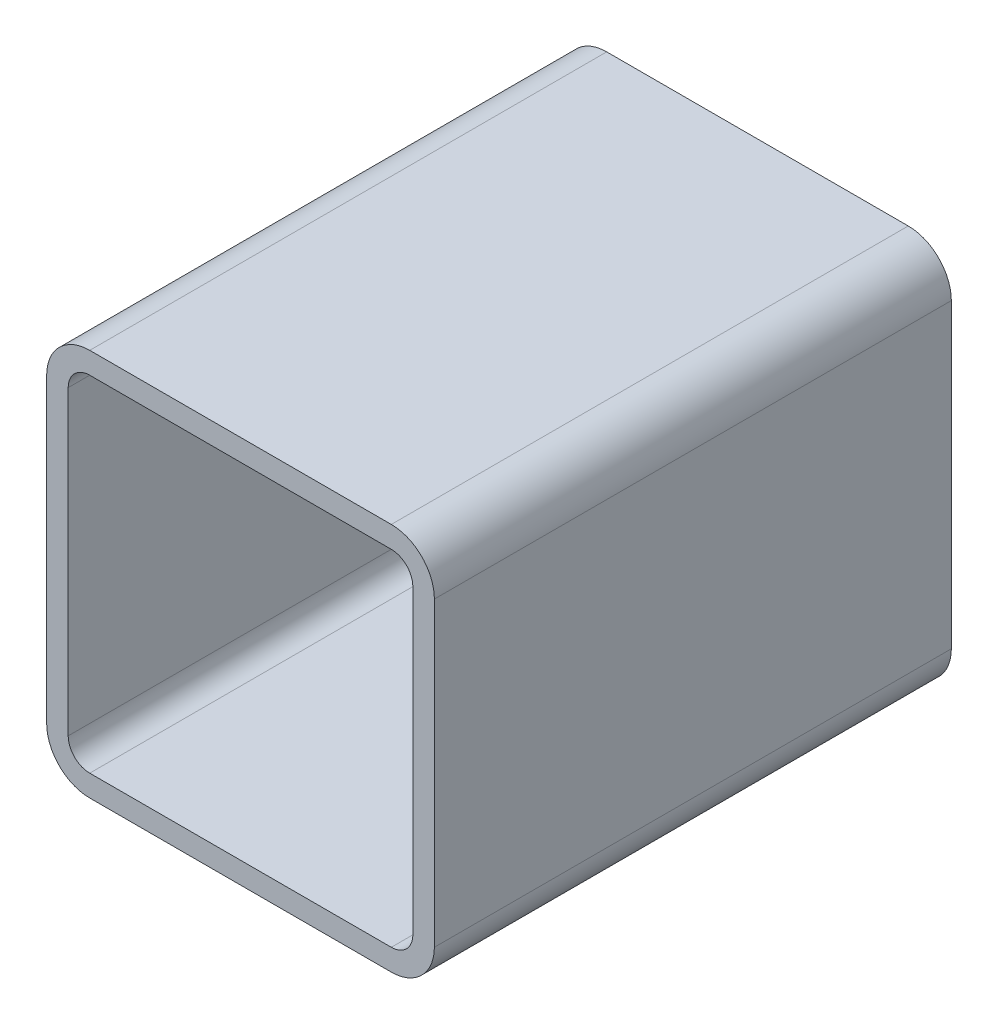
ISO-10303-21;
HEADER;
FILE_DESCRIPTION(('STEP AP214'),'2;1');
FILE_NAME('part.step','',(''),(''),'','','');
FILE_SCHEMA(('AUTOMOTIVE_DESIGN { 1 0 10303 214 1 1 1 1 }'));
ENDSEC;
DATA;
#1=APPLICATION_CONTEXT('core data for automotive mechanical design processes');
#2=APPLICATION_PROTOCOL_DEFINITION('international standard','automotive_design',2000,#1);
#3=PRODUCT_CONTEXT('',#1,'mechanical');
#4=PRODUCT('Part','Part','',(#3));
#5=PRODUCT_RELATED_PRODUCT_CATEGORY('part','',(#4));
#6=PRODUCT_DEFINITION_FORMATION('','',#4);
#7=PRODUCT_DEFINITION_CONTEXT('part definition',#1,'design');
#8=PRODUCT_DEFINITION('design','',#6,#7);
#9=PRODUCT_DEFINITION_SHAPE('','',#8);
#10=(LENGTH_UNIT() NAMED_UNIT(*) SI_UNIT(.MILLI.,.METRE.));
#11=(NAMED_UNIT(*) PLANE_ANGLE_UNIT() SI_UNIT($,.RADIAN.));
#12=(NAMED_UNIT(*) SI_UNIT($,.STERADIAN.) SOLID_ANGLE_UNIT());
#13=UNCERTAINTY_MEASURE_WITH_UNIT(LENGTH_MEASURE(1.E-05),#10,'distance_accuracy_value','');
#14=(GEOMETRIC_REPRESENTATION_CONTEXT(3) GLOBAL_UNCERTAINTY_ASSIGNED_CONTEXT((#13)) GLOBAL_UNIT_ASSIGNED_CONTEXT((#10,
#11,#12)) REPRESENTATION_CONTEXT('',''));
#15=CARTESIAN_POINT('',(0.,0.,0.));
#16=DIRECTION('',(0.,0.,1.));
#17=DIRECTION('',(1.,0.,0.));
#18=AXIS2_PLACEMENT_3D('',#15,#16,#17);
#19=CARTESIAN_POINT('',(25.9770021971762,205.143222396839,304.8));
#20=DIRECTION('',(0.,0.,1.));
#21=DIRECTION('',(1.,0.,0.));
#22=AXIS2_PLACEMENT_3D('',#19,#20,#21);
#23=PLANE('',#22);
#24=CARTESIAN_POINT('',(25.9770021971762,205.143222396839,304.8));
#25=DIRECTION('',(0.,0.,1.));
#26=DIRECTION('',(1.,0.,0.));
#27=AXIS2_PLACEMENT_3D('',#24,#25,#26);
#28=CIRCLE('',#27,25.4);
#29=CARTESIAN_POINT('',(25.9770021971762,230.543222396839,304.8));
#30=VERTEX_POINT('',#29);
#31=CARTESIAN_POINT('',(0.577002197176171,205.143222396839,304.8));
#32=VERTEX_POINT('',#31);
#33=EDGE_CURVE('E211',#30,#32,#28,.T.);
#34=ORIENTED_EDGE('',*,*,#33,.T.);
#35=DIRECTION('',(0.,-1.,0.));
#36=VECTOR('',#35,1.);
#37=CARTESIAN_POINT('',(0.577002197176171,205.143222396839,304.8));
#38=LINE('',#37,#36);
#39=CARTESIAN_POINT('',(0.577002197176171,27.3432223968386,304.8));
#40=VERTEX_POINT('',#39);
#41=EDGE_CURVE('E214',#32,#40,#38,.T.);
#42=ORIENTED_EDGE('',*,*,#41,.T.);
#43=CARTESIAN_POINT('',(25.9770021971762,27.3432223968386,304.8));
#44=DIRECTION('',(0.,0.,1.));
#45=DIRECTION('',(1.,0.,0.));
#46=AXIS2_PLACEMENT_3D('',#43,#44,#45);
#47=CIRCLE('',#46,25.4);
#48=CARTESIAN_POINT('',(25.9770021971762,1.94322239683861,304.8));
#49=VERTEX_POINT('',#48);
#50=EDGE_CURVE('E217',#40,#49,#47,.T.);
#51=ORIENTED_EDGE('',*,*,#50,.T.);
#52=DIRECTION('',(1.,0.,0.));
#53=VECTOR('',#52,1.);
#54=CARTESIAN_POINT('',(25.9770021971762,1.94322239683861,304.8));
#55=LINE('',#54,#53);
#56=CARTESIAN_POINT('',(203.777002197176,1.9432223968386,304.8));
#57=VERTEX_POINT('',#56);
#58=EDGE_CURVE('E219',#49,#57,#55,.T.);
#59=ORIENTED_EDGE('',*,*,#58,.T.);
#60=CARTESIAN_POINT('',(203.777002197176,27.3432223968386,304.8));
#61=DIRECTION('',(0.,0.,1.));
#62=DIRECTION('',(1.,0.,0.));
#63=AXIS2_PLACEMENT_3D('',#60,#61,#62);
#64=CIRCLE('',#63,25.4);
#65=CARTESIAN_POINT('',(229.177002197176,27.3432223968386,304.8));
#66=VERTEX_POINT('',#65);
#67=EDGE_CURVE('E221',#57,#66,#64,.T.);
#68=ORIENTED_EDGE('',*,*,#67,.T.);
#69=DIRECTION('',(0.,1.,0.));
#70=VECTOR('',#69,1.);
#71=CARTESIAN_POINT('',(229.177002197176,27.3432223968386,304.8));
#72=LINE('',#71,#70);
#73=CARTESIAN_POINT('',(229.177002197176,205.143222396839,304.8));
#74=VERTEX_POINT('',#73);
#75=EDGE_CURVE('E223',#66,#74,#72,.T.);
#76=ORIENTED_EDGE('',*,*,#75,.T.);
#77=CARTESIAN_POINT('',(203.777002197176,205.143222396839,304.8));
#78=DIRECTION('',(0.,0.,1.));
#79=DIRECTION('',(1.,0.,0.));
#80=AXIS2_PLACEMENT_3D('',#77,#78,#79);
#81=CIRCLE('',#80,25.4);
#82=CARTESIAN_POINT('',(203.777002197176,230.543222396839,304.8));
#83=VERTEX_POINT('',#82);
#84=EDGE_CURVE('E225',#74,#83,#81,.T.);
#85=ORIENTED_EDGE('',*,*,#84,.T.);
#86=DIRECTION('',(-1.,0.,0.));
#87=VECTOR('',#86,1.);
#88=CARTESIAN_POINT('',(203.777002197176,230.543222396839,304.8));
#89=LINE('',#88,#87);
#90=EDGE_CURVE('E227',#83,#30,#89,.T.);
#91=ORIENTED_EDGE('',*,*,#90,.T.);
#92=EDGE_LOOP('',(#34,#42,#51,#59,#68,#76,#85,#91));
#93=FACE_BOUND('',#92,.T.);
#94=DIRECTION('',(0.,-1.,0.));
#95=VECTOR('',#94,1.);
#96=CARTESIAN_POINT('',(13.2770021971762,27.3432223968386,304.8));
#97=LINE('',#96,#95);
#98=CARTESIAN_POINT('',(13.2770021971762,205.143222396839,304.8));
#99=VERTEX_POINT('',#98);
#100=CARTESIAN_POINT('',(13.2770021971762,27.3432223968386,304.8));
#101=VERTEX_POINT('',#100);
#102=EDGE_CURVE('E154',#99,#101,#97,.T.);
#103=ORIENTED_EDGE('',*,*,#102,.F.);
#104=CARTESIAN_POINT('',(25.9770021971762,205.143222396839,304.8));
#105=DIRECTION('',(0.,0.,1.));
#106=DIRECTION('',(1.,0.,0.));
#107=AXIS2_PLACEMENT_3D('',#104,#105,#106);
#108=CIRCLE('',#107,12.7);
#109=CARTESIAN_POINT('',(25.9770021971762,217.843222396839,304.8));
#110=VERTEX_POINT('',#109);
#111=EDGE_CURVE('E146',#110,#99,#108,.T.);
#112=ORIENTED_EDGE('',*,*,#111,.F.);
#113=DIRECTION('',(-1.,0.,0.));
#114=VECTOR('',#113,1.);
#115=CARTESIAN_POINT('',(25.9770021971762,217.843222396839,304.8));
#116=LINE('',#115,#114);
#117=CARTESIAN_POINT('',(203.777002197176,217.843222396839,304.8));
#118=VERTEX_POINT('',#117);
#119=EDGE_CURVE('E179',#118,#110,#116,.T.);
#120=ORIENTED_EDGE('',*,*,#119,.F.);
#121=CARTESIAN_POINT('',(203.777002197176,205.143222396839,304.8));
#122=DIRECTION('',(0.,0.,1.));
#123=DIRECTION('',(1.,0.,0.));
#124=AXIS2_PLACEMENT_3D('',#121,#122,#123);
#125=CIRCLE('',#124,12.7);
#126=CARTESIAN_POINT('',(216.477002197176,205.143222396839,304.8));
#127=VERTEX_POINT('',#126);
#128=EDGE_CURVE('E177',#127,#118,#125,.T.);
#129=ORIENTED_EDGE('',*,*,#128,.F.);
#130=DIRECTION('',(0.,1.,0.));
#131=VECTOR('',#130,1.);
#132=CARTESIAN_POINT('',(216.477002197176,205.143222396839,304.8));
#133=LINE('',#132,#131);
#134=CARTESIAN_POINT('',(216.477002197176,27.3432223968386,304.8));
#135=VERTEX_POINT('',#134);
#136=EDGE_CURVE('E175',#135,#127,#133,.T.);
#137=ORIENTED_EDGE('',*,*,#136,.F.);
#138=CARTESIAN_POINT('',(203.777002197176,27.3432223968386,304.8));
#139=DIRECTION('',(0.,0.,1.));
#140=DIRECTION('',(1.,0.,0.));
#141=AXIS2_PLACEMENT_3D('',#138,#139,#140);
#142=CIRCLE('',#141,12.7);
#143=CARTESIAN_POINT('',(203.777002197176,14.6432223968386,304.8));
#144=VERTEX_POINT('',#143);
#145=EDGE_CURVE('E173',#144,#135,#142,.T.);
#146=ORIENTED_EDGE('',*,*,#145,.F.);
#147=DIRECTION('',(1.,0.,0.));
#148=VECTOR('',#147,1.);
#149=CARTESIAN_POINT('',(203.777002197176,14.6432223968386,304.8));
#150=LINE('',#149,#148);
#151=CARTESIAN_POINT('',(25.9770021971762,14.6432223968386,304.8));
#152=VERTEX_POINT('',#151);
#153=EDGE_CURVE('E169',#152,#144,#150,.T.);
#154=ORIENTED_EDGE('',*,*,#153,.F.);
#155=CARTESIAN_POINT('',(25.9770021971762,27.3432223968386,304.8));
#156=DIRECTION('',(0.,0.,1.));
#157=DIRECTION('',(1.,0.,0.));
#158=AXIS2_PLACEMENT_3D('',#155,#156,#157);
#159=CIRCLE('',#158,12.7);
#160=EDGE_CURVE('E167',#101,#152,#159,.T.);
#161=ORIENTED_EDGE('',*,*,#160,.F.);
#162=EDGE_LOOP('',(#103,#112,#120,#129,#137,#146,#154,#161));
#163=FACE_BOUND('',#162,.T.);
#164=ADVANCED_FACE('F33',(#93,#163),#23,.T.);
#165=CARTESIAN_POINT('',(25.9770021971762,205.143222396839,0.));
#166=DIRECTION('',(0.,0.,1.));
#167=DIRECTION('',(1.,0.,0.));
#168=AXIS2_PLACEMENT_3D('',#165,#166,#167);
#169=PLANE('',#168);
#170=CARTESIAN_POINT('',(25.9770021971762,205.143222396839,0.));
#171=DIRECTION('',(0.,0.,1.));
#172=DIRECTION('',(1.,0.,0.));
#173=AXIS2_PLACEMENT_3D('',#170,#171,#172);
#174=CIRCLE('',#173,25.4);
#175=CARTESIAN_POINT('',(25.9770021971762,230.543222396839,0.));
#176=VERTEX_POINT('',#175);
#177=CARTESIAN_POINT('',(0.577002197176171,205.143222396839,0.));
#178=VERTEX_POINT('',#177);
#179=EDGE_CURVE('E162',#176,#178,#174,.T.);
#180=ORIENTED_EDGE('',*,*,#179,.F.);
#181=DIRECTION('',(-1.,0.,0.));
#182=VECTOR('',#181,1.);
#183=CARTESIAN_POINT('',(203.777002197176,230.543222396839,0.));
#184=LINE('',#183,#182);
#185=CARTESIAN_POINT('',(203.777002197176,230.543222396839,0.));
#186=VERTEX_POINT('',#185);
#187=EDGE_CURVE('E215',#186,#176,#184,.T.);
#188=ORIENTED_EDGE('',*,*,#187,.F.);
#189=CARTESIAN_POINT('',(203.777002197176,205.143222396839,0.));
#190=DIRECTION('',(0.,0.,1.));
#191=DIRECTION('',(1.,0.,0.));
#192=AXIS2_PLACEMENT_3D('',#189,#190,#191);
#193=CIRCLE('',#192,25.4);
#194=CARTESIAN_POINT('',(229.177002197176,205.143222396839,0.));
#195=VERTEX_POINT('',#194);
#196=EDGE_CURVE('E242',#195,#186,#193,.T.);
#197=ORIENTED_EDGE('',*,*,#196,.F.);
#198=DIRECTION('',(0.,1.,0.));
#199=VECTOR('',#198,1.);
#200=CARTESIAN_POINT('',(229.177002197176,27.3432223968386,0.));
#201=LINE('',#200,#199);
#202=CARTESIAN_POINT('',(229.177002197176,27.3432223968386,0.));
#203=VERTEX_POINT('',#202);
#204=EDGE_CURVE('E240',#203,#195,#201,.T.);
#205=ORIENTED_EDGE('',*,*,#204,.F.);
#206=CARTESIAN_POINT('',(203.777002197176,27.3432223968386,0.));
#207=DIRECTION('',(0.,0.,1.));
#208=DIRECTION('',(1.,0.,0.));
#209=AXIS2_PLACEMENT_3D('',#206,#207,#208);
#210=CIRCLE('',#209,25.4);
#211=CARTESIAN_POINT('',(203.777002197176,1.9432223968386,0.));
#212=VERTEX_POINT('',#211);
#213=EDGE_CURVE('E238',#212,#203,#210,.T.);
#214=ORIENTED_EDGE('',*,*,#213,.F.);
#215=DIRECTION('',(1.,0.,0.));
#216=VECTOR('',#215,1.);
#217=CARTESIAN_POINT('',(25.9770021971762,1.94322239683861,0.));
#218=LINE('',#217,#216);
#219=CARTESIAN_POINT('',(25.9770021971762,1.94322239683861,0.));
#220=VERTEX_POINT('',#219);
#221=EDGE_CURVE('E236',#220,#212,#218,.T.);
#222=ORIENTED_EDGE('',*,*,#221,.F.);
#223=CARTESIAN_POINT('',(25.9770021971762,27.3432223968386,0.));
#224=DIRECTION('',(0.,0.,1.));
#225=DIRECTION('',(1.,0.,0.));
#226=AXIS2_PLACEMENT_3D('',#223,#224,#225);
#227=CIRCLE('',#226,25.4);
#228=CARTESIAN_POINT('',(0.577002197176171,27.3432223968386,0.));
#229=VERTEX_POINT('',#228);
#230=EDGE_CURVE('E234',#229,#220,#227,.T.);
#231=ORIENTED_EDGE('',*,*,#230,.F.);
#232=DIRECTION('',(0.,-1.,0.));
#233=VECTOR('',#232,1.);
#234=CARTESIAN_POINT('',(0.577002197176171,205.143222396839,0.));
#235=LINE('',#234,#233);
#236=EDGE_CURVE('E232',#178,#229,#235,.T.);
#237=ORIENTED_EDGE('',*,*,#236,.F.);
#238=EDGE_LOOP('',(#180,#188,#197,#205,#214,#222,#231,#237));
#239=FACE_BOUND('',#238,.T.);
#240=CARTESIAN_POINT('',(25.9770021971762,205.143222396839,0.));
#241=DIRECTION('',(0.,0.,1.));
#242=DIRECTION('',(1.,0.,0.));
#243=AXIS2_PLACEMENT_3D('',#240,#241,#242);
#244=CIRCLE('',#243,12.7);
#245=CARTESIAN_POINT('',(25.9770021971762,217.843222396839,0.));
#246=VERTEX_POINT('',#245);
#247=CARTESIAN_POINT('',(13.2770021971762,205.143222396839,0.));
#248=VERTEX_POINT('',#247);
#249=EDGE_CURVE('E56',#246,#248,#244,.T.);
#250=ORIENTED_EDGE('',*,*,#249,.T.);
#251=DIRECTION('',(0.,-1.,0.));
#252=VECTOR('',#251,1.);
#253=CARTESIAN_POINT('',(13.2770021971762,27.3432223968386,0.));
#254=LINE('',#253,#252);
#255=CARTESIAN_POINT('',(13.2770021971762,27.3432223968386,0.));
#256=VERTEX_POINT('',#255);
#257=EDGE_CURVE('E161',#248,#256,#254,.T.);
#258=ORIENTED_EDGE('',*,*,#257,.T.);
#259=CARTESIAN_POINT('',(25.9770021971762,27.3432223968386,0.));
#260=DIRECTION('',(0.,0.,1.));
#261=DIRECTION('',(1.,0.,0.));
#262=AXIS2_PLACEMENT_3D('',#259,#260,#261);
#263=CIRCLE('',#262,12.7);
#264=CARTESIAN_POINT('',(25.9770021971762,14.6432223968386,0.));
#265=VERTEX_POINT('',#264);
#266=EDGE_CURVE('E183',#256,#265,#263,.T.);
#267=ORIENTED_EDGE('',*,*,#266,.T.);
#268=DIRECTION('',(1.,0.,0.));
#269=VECTOR('',#268,1.);
#270=CARTESIAN_POINT('',(203.777002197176,14.6432223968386,0.));
#271=LINE('',#270,#269);
#272=CARTESIAN_POINT('',(203.777002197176,14.6432223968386,0.));
#273=VERTEX_POINT('',#272);
#274=EDGE_CURVE('E186',#265,#273,#271,.T.);
#275=ORIENTED_EDGE('',*,*,#274,.T.);
#276=CARTESIAN_POINT('',(203.777002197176,27.3432223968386,0.));
#277=DIRECTION('',(0.,0.,1.));
#278=DIRECTION('',(1.,0.,0.));
#279=AXIS2_PLACEMENT_3D('',#276,#277,#278);
#280=CIRCLE('',#279,12.7);
#281=CARTESIAN_POINT('',(216.477002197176,27.3432223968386,0.));
#282=VERTEX_POINT('',#281);
#283=EDGE_CURVE('E189',#273,#282,#280,.T.);
#284=ORIENTED_EDGE('',*,*,#283,.T.);
#285=DIRECTION('',(0.,1.,0.));
#286=VECTOR('',#285,1.);
#287=CARTESIAN_POINT('',(216.477002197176,205.143222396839,0.));
#288=LINE('',#287,#286);
#289=CARTESIAN_POINT('',(216.477002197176,205.143222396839,0.));
#290=VERTEX_POINT('',#289);
#291=EDGE_CURVE('E192',#282,#290,#288,.T.);
#292=ORIENTED_EDGE('',*,*,#291,.T.);
#293=CARTESIAN_POINT('',(203.777002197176,205.143222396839,0.));
#294=DIRECTION('',(0.,0.,1.));
#295=DIRECTION('',(1.,0.,0.));
#296=AXIS2_PLACEMENT_3D('',#293,#294,#295);
#297=CIRCLE('',#296,12.7);
#298=CARTESIAN_POINT('',(203.777002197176,217.843222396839,0.));
#299=VERTEX_POINT('',#298);
#300=EDGE_CURVE('E195',#290,#299,#297,.T.);
#301=ORIENTED_EDGE('',*,*,#300,.T.);
#302=DIRECTION('',(-1.,0.,0.));
#303=VECTOR('',#302,1.);
#304=CARTESIAN_POINT('',(25.9770021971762,217.843222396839,0.));
#305=LINE('',#304,#303);
#306=EDGE_CURVE('E155',#299,#246,#305,.T.);
#307=ORIENTED_EDGE('',*,*,#306,.T.);
#308=EDGE_LOOP('',(#250,#258,#267,#275,#284,#292,#301,#307));
#309=FACE_BOUND('',#308,.T.);
#310=ADVANCED_FACE('F272',(#239,#309),#169,.F.);
#311=CARTESIAN_POINT('',(25.9770021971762,205.143222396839,304.8));
#312=DIRECTION('',(0.,0.,-1.));
#313=DIRECTION('',(-1.,0.,0.));
#314=AXIS2_PLACEMENT_3D('',#311,#312,#313);
#315=CYLINDRICAL_SURFACE('',#314,25.4);
#316=ORIENTED_EDGE('',*,*,#179,.T.);
#317=DIRECTION('',(0.,0.,-1.));
#318=VECTOR('',#317,1.);
#319=CARTESIAN_POINT('',(0.577002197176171,205.143222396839,304.8));
#320=LINE('',#319,#318);
#321=EDGE_CURVE('E11',#32,#178,#320,.T.);
#322=ORIENTED_EDGE('',*,*,#321,.F.);
#323=ORIENTED_EDGE('',*,*,#33,.F.);
#324=DIRECTION('',(0.,0.,-1.));
#325=VECTOR('',#324,1.);
#326=CARTESIAN_POINT('',(25.9770021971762,230.543222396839,304.8));
#327=LINE('',#326,#325);
#328=EDGE_CURVE('E229',#30,#176,#327,.T.);
#329=ORIENTED_EDGE('',*,*,#328,.T.);
#330=EDGE_LOOP('',(#316,#322,#323,#329));
#331=FACE_BOUND('',#330,.T.);
#332=ADVANCED_FACE('F35',(#331),#315,.T.);
#333=CARTESIAN_POINT('',(0.577002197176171,205.143222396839,304.8));
#334=DIRECTION('',(1.,0.,0.));
#335=DIRECTION('',(0.,0.,-1.));
#336=AXIS2_PLACEMENT_3D('',#333,#334,#335);
#337=PLANE('',#336);
#338=ORIENTED_EDGE('',*,*,#236,.T.);
#339=DIRECTION('',(0.,0.,-1.));
#340=VECTOR('',#339,1.);
#341=CARTESIAN_POINT('',(0.577002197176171,27.3432223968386,304.8));
#342=LINE('',#341,#340);
#343=EDGE_CURVE('E41',#40,#229,#342,.T.);
#344=ORIENTED_EDGE('',*,*,#343,.F.);
#345=ORIENTED_EDGE('',*,*,#41,.F.);
#346=ORIENTED_EDGE('',*,*,#321,.T.);
#347=EDGE_LOOP('',(#338,#344,#345,#346));
#348=FACE_BOUND('',#347,.T.);
#349=ADVANCED_FACE('F289',(#348),#337,.F.);
#350=CARTESIAN_POINT('',(25.9770021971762,27.3432223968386,304.8));
#351=DIRECTION('',(0.,0.,-1.));
#352=DIRECTION('',(-1.,0.,0.));
#353=AXIS2_PLACEMENT_3D('',#350,#351,#352);
#354=CYLINDRICAL_SURFACE('',#353,25.4);
#355=ORIENTED_EDGE('',*,*,#230,.T.);
#356=DIRECTION('',(0.,0.,-1.));
#357=VECTOR('',#356,1.);
#358=CARTESIAN_POINT('',(25.9770021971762,1.94322239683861,304.8));
#359=LINE('',#358,#357);
#360=EDGE_CURVE('E259',#49,#220,#359,.T.);
#361=ORIENTED_EDGE('',*,*,#360,.F.);
#362=ORIENTED_EDGE('',*,*,#50,.F.);
#363=ORIENTED_EDGE('',*,*,#343,.T.);
#364=EDGE_LOOP('',(#355,#361,#362,#363));
#365=FACE_BOUND('',#364,.T.);
#366=ADVANCED_FACE('F266',(#365),#354,.T.);
#367=CARTESIAN_POINT('',(25.9770021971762,1.94322239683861,304.8));
#368=DIRECTION('',(0.,1.,0.));
#369=DIRECTION('',(0.,0.,1.));
#370=AXIS2_PLACEMENT_3D('',#367,#368,#369);
#371=PLANE('',#370);
#372=ORIENTED_EDGE('',*,*,#221,.T.);
#373=DIRECTION('',(0.,0.,-1.));
#374=VECTOR('',#373,1.);
#375=CARTESIAN_POINT('',(203.777002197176,1.9432223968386,304.8));
#376=LINE('',#375,#374);
#377=EDGE_CURVE('E256',#57,#212,#376,.T.);
#378=ORIENTED_EDGE('',*,*,#377,.F.);
#379=ORIENTED_EDGE('',*,*,#58,.F.);
#380=ORIENTED_EDGE('',*,*,#360,.T.);
#381=EDGE_LOOP('',(#372,#378,#379,#380));
#382=FACE_BOUND('',#381,.T.);
#383=ADVANCED_FACE('F278',(#382),#371,.F.);
#384=CARTESIAN_POINT('',(203.777002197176,27.3432223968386,304.8));
#385=DIRECTION('',(0.,0.,-1.));
#386=DIRECTION('',(-1.,0.,0.));
#387=AXIS2_PLACEMENT_3D('',#384,#385,#386);
#388=CYLINDRICAL_SURFACE('',#387,25.4);
#389=ORIENTED_EDGE('',*,*,#213,.T.);
#390=DIRECTION('',(0.,0.,-1.));
#391=VECTOR('',#390,1.);
#392=CARTESIAN_POINT('',(229.177002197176,27.3432223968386,304.8));
#393=LINE('',#392,#391);
#394=EDGE_CURVE('E253',#66,#203,#393,.T.);
#395=ORIENTED_EDGE('',*,*,#394,.F.);
#396=ORIENTED_EDGE('',*,*,#67,.F.);
#397=ORIENTED_EDGE('',*,*,#377,.T.);
#398=EDGE_LOOP('',(#389,#395,#396,#397));
#399=FACE_BOUND('',#398,.T.);
#400=ADVANCED_FACE('F282',(#399),#388,.T.);
#401=CARTESIAN_POINT('',(229.177002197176,27.3432223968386,304.8));
#402=DIRECTION('',(-1.,0.,0.));
#403=DIRECTION('',(0.,0.,1.));
#404=AXIS2_PLACEMENT_3D('',#401,#402,#403);
#405=PLANE('',#404);
#406=ORIENTED_EDGE('',*,*,#204,.T.);
#407=DIRECTION('',(0.,0.,-1.));
#408=VECTOR('',#407,1.);
#409=CARTESIAN_POINT('',(229.177002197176,205.143222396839,304.8));
#410=LINE('',#409,#408);
#411=EDGE_CURVE('E250',#74,#195,#410,.T.);
#412=ORIENTED_EDGE('',*,*,#411,.F.);
#413=ORIENTED_EDGE('',*,*,#75,.F.);
#414=ORIENTED_EDGE('',*,*,#394,.T.);
#415=EDGE_LOOP('',(#406,#412,#413,#414));
#416=FACE_BOUND('',#415,.T.);
#417=ADVANCED_FACE('F302',(#416),#405,.F.);
#418=CARTESIAN_POINT('',(203.777002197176,205.143222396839,304.8));
#419=DIRECTION('',(0.,0.,-1.));
#420=DIRECTION('',(-1.,0.,0.));
#421=AXIS2_PLACEMENT_3D('',#418,#419,#420);
#422=CYLINDRICAL_SURFACE('',#421,25.4);
#423=ORIENTED_EDGE('',*,*,#196,.T.);
#424=DIRECTION('',(0.,0.,-1.));
#425=VECTOR('',#424,1.);
#426=CARTESIAN_POINT('',(203.777002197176,230.543222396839,304.8));
#427=LINE('',#426,#425);
#428=EDGE_CURVE('E247',#83,#186,#427,.T.);
#429=ORIENTED_EDGE('',*,*,#428,.F.);
#430=ORIENTED_EDGE('',*,*,#84,.F.);
#431=ORIENTED_EDGE('',*,*,#411,.T.);
#432=EDGE_LOOP('',(#423,#429,#430,#431));
#433=FACE_BOUND('',#432,.T.);
#434=ADVANCED_FACE('F300',(#433),#422,.T.);
#435=CARTESIAN_POINT('',(203.777002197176,230.543222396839,304.8));
#436=DIRECTION('',(0.,-1.,0.));
#437=DIRECTION('',(0.,0.,-1.));
#438=AXIS2_PLACEMENT_3D('',#435,#436,#437);
#439=PLANE('',#438);
#440=ORIENTED_EDGE('',*,*,#187,.T.);
#441=ORIENTED_EDGE('',*,*,#328,.F.);
#442=ORIENTED_EDGE('',*,*,#90,.F.);
#443=ORIENTED_EDGE('',*,*,#428,.T.);
#444=EDGE_LOOP('',(#440,#441,#442,#443));
#445=FACE_BOUND('',#444,.T.);
#446=ADVANCED_FACE('F295',(#445),#439,.F.);
#447=CARTESIAN_POINT('',(25.9770021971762,205.143222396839,304.8));
#448=DIRECTION('',(0.,0.,-1.));
#449=DIRECTION('',(-1.,0.,0.));
#450=AXIS2_PLACEMENT_3D('',#447,#448,#449);
#451=CYLINDRICAL_SURFACE('',#450,12.7);
#452=ORIENTED_EDGE('',*,*,#249,.F.);
#453=DIRECTION('',(0.,0.,-1.));
#454=VECTOR('',#453,1.);
#455=CARTESIAN_POINT('',(25.9770021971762,217.843222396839,304.8));
#456=LINE('',#455,#454);
#457=EDGE_CURVE('E150',#110,#246,#456,.T.);
#458=ORIENTED_EDGE('',*,*,#457,.F.);
#459=ORIENTED_EDGE('',*,*,#111,.T.);
#460=DIRECTION('',(0.,0.,-1.));
#461=VECTOR('',#460,1.);
#462=CARTESIAN_POINT('',(13.2770021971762,205.143222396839,304.8));
#463=LINE('',#462,#461);
#464=EDGE_CURVE('E149',#99,#248,#463,.T.);
#465=ORIENTED_EDGE('',*,*,#464,.T.);
#466=EDGE_LOOP('',(#452,#458,#459,#465));
#467=FACE_BOUND('',#466,.T.);
#468=ADVANCED_FACE('F148',(#467),#451,.F.);
#469=CARTESIAN_POINT('',(13.2770021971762,27.3432223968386,304.8));
#470=DIRECTION('',(1.,0.,0.));
#471=DIRECTION('',(0.,0.,-1.));
#472=AXIS2_PLACEMENT_3D('',#469,#470,#471);
#473=PLANE('',#472);
#474=ORIENTED_EDGE('',*,*,#257,.F.);
#475=ORIENTED_EDGE('',*,*,#464,.F.);
#476=ORIENTED_EDGE('',*,*,#102,.T.);
#477=DIRECTION('',(0.,0.,-1.));
#478=VECTOR('',#477,1.);
#479=CARTESIAN_POINT('',(13.2770021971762,27.3432223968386,304.8));
#480=LINE('',#479,#478);
#481=EDGE_CURVE('E163',#101,#256,#480,.T.);
#482=ORIENTED_EDGE('',*,*,#481,.T.);
#483=EDGE_LOOP('',(#474,#475,#476,#482));
#484=FACE_BOUND('',#483,.T.);
#485=ADVANCED_FACE('F158',(#484),#473,.T.);
#486=CARTESIAN_POINT('',(25.9770021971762,27.3432223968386,304.8));
#487=DIRECTION('',(0.,0.,-1.));
#488=DIRECTION('',(-1.,0.,0.));
#489=AXIS2_PLACEMENT_3D('',#486,#487,#488);
#490=CYLINDRICAL_SURFACE('',#489,12.7);
#491=ORIENTED_EDGE('',*,*,#266,.F.);
#492=ORIENTED_EDGE('',*,*,#481,.F.);
#493=ORIENTED_EDGE('',*,*,#160,.T.);
#494=DIRECTION('',(0.,0.,-1.));
#495=VECTOR('',#494,1.);
#496=CARTESIAN_POINT('',(25.9770021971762,14.6432223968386,304.8));
#497=LINE('',#496,#495);
#498=EDGE_CURVE('E208',#152,#265,#497,.T.);
#499=ORIENTED_EDGE('',*,*,#498,.T.);
#500=EDGE_LOOP('',(#491,#492,#493,#499));
#501=FACE_BOUND('',#500,.T.);
#502=ADVANCED_FACE('F327',(#501),#490,.F.);
#503=CARTESIAN_POINT('',(203.777002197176,14.6432223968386,304.8));
#504=DIRECTION('',(0.,1.,0.));
#505=DIRECTION('',(0.,0.,1.));
#506=AXIS2_PLACEMENT_3D('',#503,#504,#505);
#507=PLANE('',#506);
#508=ORIENTED_EDGE('',*,*,#274,.F.);
#509=ORIENTED_EDGE('',*,*,#498,.F.);
#510=ORIENTED_EDGE('',*,*,#153,.T.);
#511=DIRECTION('',(0.,0.,-1.));
#512=VECTOR('',#511,1.);
#513=CARTESIAN_POINT('',(203.777002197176,14.6432223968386,304.8));
#514=LINE('',#513,#512);
#515=EDGE_CURVE('E206',#144,#273,#514,.T.);
#516=ORIENTED_EDGE('',*,*,#515,.T.);
#517=EDGE_LOOP('',(#508,#509,#510,#516));
#518=FACE_BOUND('',#517,.T.);
#519=ADVANCED_FACE('F331',(#518),#507,.T.);
#520=CARTESIAN_POINT('',(203.777002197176,27.3432223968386,304.8));
#521=DIRECTION('',(0.,0.,-1.));
#522=DIRECTION('',(-1.,0.,0.));
#523=AXIS2_PLACEMENT_3D('',#520,#521,#522);
#524=CYLINDRICAL_SURFACE('',#523,12.7);
#525=ORIENTED_EDGE('',*,*,#283,.F.);
#526=ORIENTED_EDGE('',*,*,#515,.F.);
#527=ORIENTED_EDGE('',*,*,#145,.T.);
#528=DIRECTION('',(0.,0.,-1.));
#529=VECTOR('',#528,1.);
#530=CARTESIAN_POINT('',(216.477002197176,27.3432223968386,304.8));
#531=LINE('',#530,#529);
#532=EDGE_CURVE('E204',#135,#282,#531,.T.);
#533=ORIENTED_EDGE('',*,*,#532,.T.);
#534=EDGE_LOOP('',(#525,#526,#527,#533));
#535=FACE_BOUND('',#534,.T.);
#536=ADVANCED_FACE('F337',(#535),#524,.F.);
#537=CARTESIAN_POINT('',(216.477002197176,205.143222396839,304.8));
#538=DIRECTION('',(-1.,0.,0.));
#539=DIRECTION('',(0.,0.,1.));
#540=AXIS2_PLACEMENT_3D('',#537,#538,#539);
#541=PLANE('',#540);
#542=ORIENTED_EDGE('',*,*,#291,.F.);
#543=ORIENTED_EDGE('',*,*,#532,.F.);
#544=ORIENTED_EDGE('',*,*,#136,.T.);
#545=DIRECTION('',(0.,0.,-1.));
#546=VECTOR('',#545,1.);
#547=CARTESIAN_POINT('',(216.477002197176,205.143222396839,304.8));
#548=LINE('',#547,#546);
#549=EDGE_CURVE('E202',#127,#290,#548,.T.);
#550=ORIENTED_EDGE('',*,*,#549,.T.);
#551=EDGE_LOOP('',(#542,#543,#544,#550));
#552=FACE_BOUND('',#551,.T.);
#553=ADVANCED_FACE('F341',(#552),#541,.T.);
#554=CARTESIAN_POINT('',(203.777002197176,205.143222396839,304.8));
#555=DIRECTION('',(0.,0.,-1.));
#556=DIRECTION('',(-1.,0.,0.));
#557=AXIS2_PLACEMENT_3D('',#554,#555,#556);
#558=CYLINDRICAL_SURFACE('',#557,12.7);
#559=ORIENTED_EDGE('',*,*,#300,.F.);
#560=ORIENTED_EDGE('',*,*,#549,.F.);
#561=ORIENTED_EDGE('',*,*,#128,.T.);
#562=DIRECTION('',(0.,0.,-1.));
#563=VECTOR('',#562,1.);
#564=CARTESIAN_POINT('',(203.777002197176,217.843222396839,304.8));
#565=LINE('',#564,#563);
#566=EDGE_CURVE('E48',#118,#299,#565,.T.);
#567=ORIENTED_EDGE('',*,*,#566,.T.);
#568=EDGE_LOOP('',(#559,#560,#561,#567));
#569=FACE_BOUND('',#568,.T.);
#570=ADVANCED_FACE('F345',(#569),#558,.F.);
#571=CARTESIAN_POINT('',(25.9770021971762,217.843222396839,304.8));
#572=DIRECTION('',(0.,-1.,0.));
#573=DIRECTION('',(0.,0.,-1.));
#574=AXIS2_PLACEMENT_3D('',#571,#572,#573);
#575=PLANE('',#574);
#576=ORIENTED_EDGE('',*,*,#306,.F.);
#577=ORIENTED_EDGE('',*,*,#566,.F.);
#578=ORIENTED_EDGE('',*,*,#119,.T.);
#579=ORIENTED_EDGE('',*,*,#457,.T.);
#580=EDGE_LOOP('',(#576,#577,#578,#579));
#581=FACE_BOUND('',#580,.T.);
#582=ADVANCED_FACE('F349',(#581),#575,.T.);
#583=CLOSED_SHELL('',(#164,#310,#332,#349,#366,#383,#400,#417,#434,#446,#468,#485,#502,#519,
#536,#553,#570,#582));
#584=MANIFOLD_SOLID_BREP('B2',#583);
#585=ADVANCED_BREP_SHAPE_REPRESENTATION('',(#18,#584),#14);
#586=SHAPE_DEFINITION_REPRESENTATION(#9,#585);
ENDSEC;
END-ISO-10303-21;
